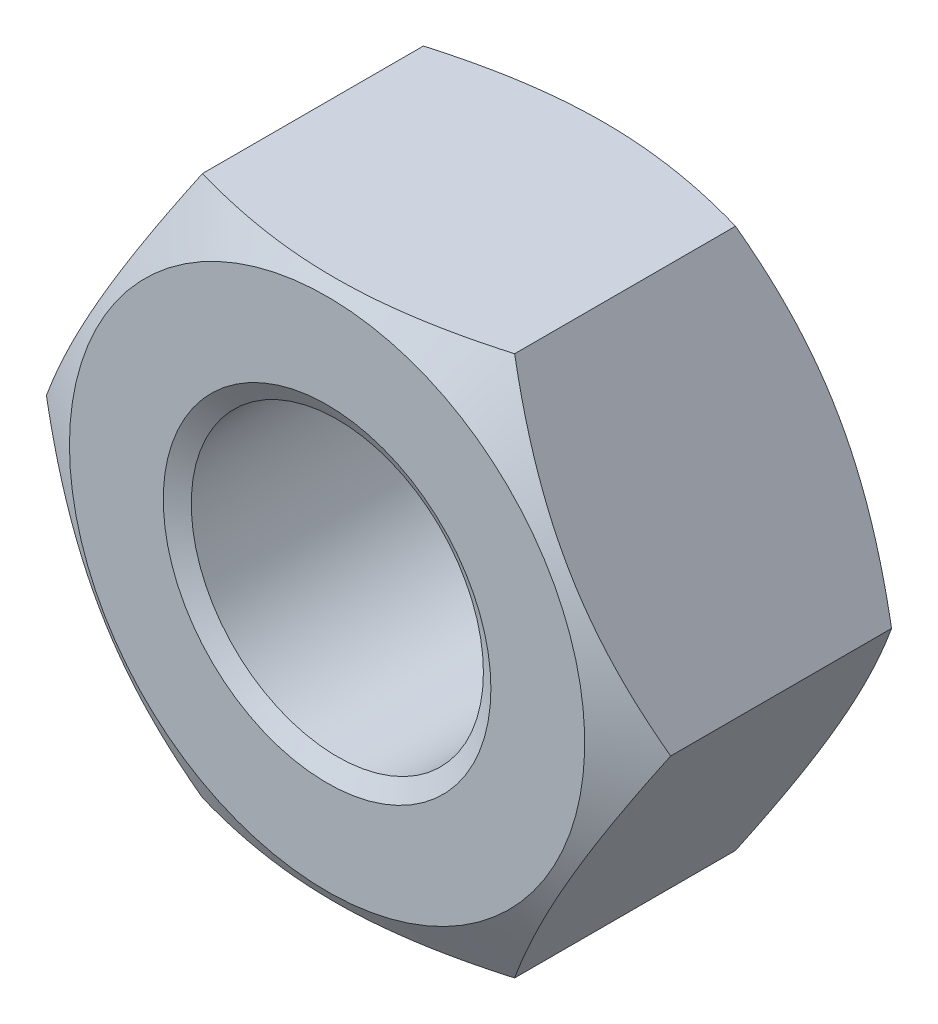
ISO-10303-21;
HEADER;
FILE_DESCRIPTION(('STEP AP214'),'2;1');
FILE_NAME('part.step','',(''),(''),'','','');
FILE_SCHEMA(('AUTOMOTIVE_DESIGN { 1 0 10303 214 1 1 1 1 }'));
ENDSEC;
DATA;
#1=APPLICATION_CONTEXT('core data for automotive mechanical design processes');
#2=APPLICATION_PROTOCOL_DEFINITION('international standard','automotive_design',2000,#1);
#3=PRODUCT_CONTEXT('',#1,'mechanical');
#4=PRODUCT('Part','Part','',(#3));
#5=PRODUCT_RELATED_PRODUCT_CATEGORY('part','',(#4));
#6=PRODUCT_DEFINITION_FORMATION('','',#4);
#7=PRODUCT_DEFINITION_CONTEXT('part definition',#1,'design');
#8=PRODUCT_DEFINITION('design','',#6,#7);
#9=PRODUCT_DEFINITION_SHAPE('','',#8);
#10=(LENGTH_UNIT() NAMED_UNIT(*) SI_UNIT(.MILLI.,.METRE.));
#11=(NAMED_UNIT(*) PLANE_ANGLE_UNIT() SI_UNIT($,.RADIAN.));
#12=(NAMED_UNIT(*) SI_UNIT($,.STERADIAN.) SOLID_ANGLE_UNIT());
#13=UNCERTAINTY_MEASURE_WITH_UNIT(LENGTH_MEASURE(1.E-05),#10,'distance_accuracy_value','');
#14=(GEOMETRIC_REPRESENTATION_CONTEXT(3) GLOBAL_UNCERTAINTY_ASSIGNED_CONTEXT((#13)) GLOBAL_UNIT_ASSIGNED_CONTEXT((#10,
#11,#12)) REPRESENTATION_CONTEXT('',''));
#15=CARTESIAN_POINT('',(0.,0.,0.));
#16=DIRECTION('',(0.,0.,1.));
#17=DIRECTION('',(1.,0.,0.));
#18=AXIS2_PLACEMENT_3D('',#15,#16,#17);
#19=CARTESIAN_POINT('',(-13.856406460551,-8.,0.));
#20=DIRECTION('',(0.,0.,-1.));
#21=DIRECTION('',(-1.,0.,0.));
#22=AXIS2_PLACEMENT_3D('',#19,#20,#21);
#23=PLANE('',#22);
#24=CARTESIAN_POINT('',(0.,0.,0.));
#25=DIRECTION('',(0.,0.,-1.));
#26=DIRECTION('',(-1.,0.,0.));
#27=AXIS2_PLACEMENT_3D('',#24,#25,#26);
#28=CIRCLE('',#27,7.625);
#29=CARTESIAN_POINT('',(-7.625,0.,0.));
#30=VERTEX_POINT('',#29);
#31=EDGE_CURVE('E136',#30,#30,#28,.T.);
#32=ORIENTED_EDGE('',*,*,#31,.F.);
#33=EDGE_LOOP('',(#32));
#34=FACE_BOUND('',#33,.T.);
#35=CARTESIAN_POINT('',(0.,0.,0.));
#36=DIRECTION('',(0.,0.,1.));
#37=DIRECTION('',(1.,0.,0.));
#38=AXIS2_PLACEMENT_3D('',#35,#36,#37);
#39=CIRCLE('',#38,4.84849999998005);
#40=CARTESIAN_POINT('',(4.84849999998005,0.,0.));
#41=VERTEX_POINT('',#40);
#42=EDGE_CURVE('E20',#41,#41,#39,.F.);
#43=ORIENTED_EDGE('',*,*,#42,.T.);
#44=EDGE_LOOP('',(#43));
#45=FACE_BOUND('',#44,.T.);
#46=ADVANCED_FACE('F17',(#34,#45),#23,.F.);
#47=CARTESIAN_POINT('',(0.,0.,0.));
#48=DIRECTION('',(0.,0.,1.));
#49=DIRECTION('',(1.,0.,0.));
#50=AXIS2_PLACEMENT_3D('',#47,#48,#49);
#51=CONICAL_SURFACE('',#50,4.84849999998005,1.04719755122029);
#52=CARTESIAN_POINT('',(0.,0.,-0.303108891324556));
#53=DIRECTION('',(0.,0.,1.));
#54=DIRECTION('',(1.,0.,0.));
#55=AXIS2_PLACEMENT_3D('',#52,#53,#54);
#56=CIRCLE('',#55,4.3235);
#57=CARTESIAN_POINT('',(4.3235,0.,-0.303108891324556));
#58=VERTEX_POINT('',#57);
#59=EDGE_CURVE('E71',#58,#58,#56,.F.);
#60=ORIENTED_EDGE('',*,*,#59,.T.);
#61=EDGE_LOOP('',(#60));
#62=FACE_BOUND('',#61,.T.);
#63=ORIENTED_EDGE('',*,*,#42,.F.);
#64=EDGE_LOOP('',(#63));
#65=FACE_BOUND('',#64,.T.);
#66=ADVANCED_FACE('F111',(#62,#65),#51,.F.);
#67=CARTESIAN_POINT('',(0.,0.,-0.936623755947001));
#68=DIRECTION('',(0.,0.,-1.));
#69=DIRECTION('',(-1.,0.,0.));
#70=AXIS2_PLACEMENT_3D('',#67,#68,#69);
#71=CONICAL_SURFACE('',#70,9.24727993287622,1.0471975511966);
#72=CARTESIAN_POINT('',(9.23760430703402,0.,-0.931037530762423));
#73=CARTESIAN_POINT('',(9.13607893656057,-0.175847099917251,-0.872433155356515));
#74=CARTESIAN_POINT('',(9.03417504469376,-0.352349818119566,-0.816488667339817));
#75=CARTESIAN_POINT('',(8.82953967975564,-0.7067886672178,-0.710652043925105));
#76=CARTESIAN_POINT('',(8.72680786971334,-0.884725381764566,-0.660762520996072));
#77=CARTESIAN_POINT('',(8.41696767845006,-1.42138433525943,-0.521155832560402));
#78=CARTESIAN_POINT('',(8.20863625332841,-1.78222494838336,-0.441750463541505));
#79=CARTESIAN_POINT('',(7.89687232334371,-2.32221591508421,-0.348640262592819));
#80=CARTESIAN_POINT('',(7.79437112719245,-2.49975319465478,-0.322116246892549));
#81=CARTESIAN_POINT('',(7.5889052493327,-2.85563053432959,-0.277640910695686));
#82=CARTESIAN_POINT('',(7.48594060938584,-3.0339705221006,-0.259688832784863));
#83=CARTESIAN_POINT('',(7.2798340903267,-3.39095748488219,-0.232812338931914));
#84=CARTESIAN_POINT('',(7.17669254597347,-3.56960388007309,-0.223877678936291));
#85=CARTESIAN_POINT('',(6.97031423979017,-3.92706159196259,-0.215227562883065));
#86=CARTESIAN_POINT('',(6.86707748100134,-4.10587290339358,-0.215511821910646));
#87=CARTESIAN_POINT('',(6.67408002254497,-4.44015430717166,-0.224657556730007));
#88=CARTESIAN_POINT('',(6.58430568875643,-4.59564801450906,-0.232403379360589));
#89=CARTESIAN_POINT('',(6.40496729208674,-4.90627122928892,-0.254716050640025));
#90=CARTESIAN_POINT('',(6.31540324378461,-5.06140071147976,-0.269283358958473));
#91=CARTESIAN_POINT('',(6.04705785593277,-5.52618855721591,-0.32287323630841));
#92=CARTESIAN_POINT('',(5.86875148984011,-5.83502424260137,-0.371777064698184));
#93=CARTESIAN_POINT('',(5.51024760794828,-6.4559711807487,-0.494034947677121));
#94=CARTESIAN_POINT('',(5.33009583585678,-6.76800320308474,-0.567907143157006));
#95=CARTESIAN_POINT('',(4.97247850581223,-7.38741458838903,-0.735565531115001));
#96=CARTESIAN_POINT('',(4.79500836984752,-7.69480188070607,-0.829312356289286));
#97=CARTESIAN_POINT('',(4.618802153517,-8.,-0.93103753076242));
#98=B_SPLINE_CURVE_WITH_KNOTS('',3,(#72,#73,#74,#75,#76,#77,#78,#79,#80,#81,#82,#83,#84,#85,#86,
#87,#88,#89,#90,#91,#92,#93,#94,#95,#96,#97),.UNSPECIFIED.,.F.,.F.,(4,2,2,2,2,2,2,2,2,2,2,2,4),
(0.,0.633965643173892,1.26820385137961,2.53931507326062,3.15930423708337,3.77923860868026,
4.39846792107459,5.01767809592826,5.55669078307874,6.09573979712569,7.17460544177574,
8.27739515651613,9.37802056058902),.UNSPECIFIED.);
#99=CARTESIAN_POINT('',(9.23760430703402,0.,-0.931037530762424));
#100=VERTEX_POINT('',#99);
#101=CARTESIAN_POINT('',(4.618802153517,-8.,-0.931037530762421));
#102=VERTEX_POINT('',#101);
#103=EDGE_CURVE('E62',#100,#102,#98,.T.);
#104=ORIENTED_EDGE('',*,*,#103,.F.);
#105=CARTESIAN_POINT('',(4.618802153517,8.00000000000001,-0.931037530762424));
#106=CARTESIAN_POINT('',(4.72032752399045,7.82415290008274,-0.872433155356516));
#107=CARTESIAN_POINT('',(4.82223141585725,7.64765018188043,-0.816488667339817));
#108=CARTESIAN_POINT('',(5.02686678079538,7.2932113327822,-0.710652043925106));
#109=CARTESIAN_POINT('',(5.12959859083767,7.11527461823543,-0.660762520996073));
#110=CARTESIAN_POINT('',(5.43943878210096,6.57861566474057,-0.521155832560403));
#111=CARTESIAN_POINT('',(5.64777020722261,6.21777505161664,-0.441750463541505));
#112=CARTESIAN_POINT('',(5.95953413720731,5.67778408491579,-0.34864026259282));
#113=CARTESIAN_POINT('',(6.06203533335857,5.50024680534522,-0.322116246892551));
#114=CARTESIAN_POINT('',(6.26750121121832,5.1443694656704,-0.277640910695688));
#115=CARTESIAN_POINT('',(6.37046585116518,4.9660294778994,-0.259688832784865));
#116=CARTESIAN_POINT('',(6.57657237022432,4.6090425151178,-0.232812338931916));
#117=CARTESIAN_POINT('',(6.67971391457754,4.4303961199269,-0.223877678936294));
#118=CARTESIAN_POINT('',(6.88609222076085,4.07293840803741,-0.215227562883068));
#119=CARTESIAN_POINT('',(6.98932897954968,3.89412709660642,-0.215511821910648));
#120=CARTESIAN_POINT('',(7.18232643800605,3.55984569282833,-0.224657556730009));
#121=CARTESIAN_POINT('',(7.27210077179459,3.40435198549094,-0.232403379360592));
#122=CARTESIAN_POINT('',(7.45143916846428,3.09372877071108,-0.254716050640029));
#123=CARTESIAN_POINT('',(7.54100321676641,2.93859928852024,-0.269283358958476));
#124=CARTESIAN_POINT('',(7.80934860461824,2.47381144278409,-0.322873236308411));
#125=CARTESIAN_POINT('',(7.9876549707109,2.16497575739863,-0.371777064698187));
#126=CARTESIAN_POINT('',(8.34615885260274,1.5440288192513,-0.494034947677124));
#127=CARTESIAN_POINT('',(8.52631062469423,1.23199679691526,-0.567907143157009));
#128=CARTESIAN_POINT('',(8.88392795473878,0.612585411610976,-0.735565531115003));
#129=CARTESIAN_POINT('',(9.0613980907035,0.305198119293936,-0.829312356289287));
#130=CARTESIAN_POINT('',(9.23760430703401,0.,-0.931037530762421));
#131=B_SPLINE_CURVE_WITH_KNOTS('',3,(#105,#106,#107,#108,#109,#110,#111,#112,#113,#114,#115,
#116,#117,#118,#119,#120,#121,#122,#123,#124,#125,#126,#127,#128,#129,#130),.UNSPECIFIED.,.F.,
.F.,(4,2,2,2,2,2,2,2,2,2,2,2,4),(0.,0.633965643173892,1.26820385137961,2.53931507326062,
3.15930423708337,3.77923860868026,4.39846792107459,5.01767809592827,5.55669078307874,
6.09573979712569,7.17460544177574,8.27739515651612,9.37802056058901),.UNSPECIFIED.);
#132=CARTESIAN_POINT('',(4.618802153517,8.,-0.931037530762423));
#133=VERTEX_POINT('',#132);
#134=EDGE_CURVE('E66',#133,#100,#131,.T.);
#135=ORIENTED_EDGE('',*,*,#134,.F.);
#136=CARTESIAN_POINT('',(-4.618802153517,8.,-0.931037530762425));
#137=CARTESIAN_POINT('',(-4.41575141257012,8.,-0.872433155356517));
#138=CARTESIAN_POINT('',(-4.2119436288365,8.,-0.816488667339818));
#139=CARTESIAN_POINT('',(-3.80267289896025,8.,-0.710652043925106));
#140=CARTESIAN_POINT('',(-3.59720927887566,8.,-0.660762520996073));
#141=CARTESIAN_POINT('',(-2.9775288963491,8.,-0.521155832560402));
#142=CARTESIAN_POINT('',(-2.5608660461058,8.,-0.441750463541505));
#143=CARTESIAN_POINT('',(-1.93733818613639,8.,-0.34864026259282));
#144=CARTESIAN_POINT('',(-1.73233579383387,8.,-0.322116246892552));
#145=CARTESIAN_POINT('',(-1.32140403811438,8.,-0.277640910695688));
#146=CARTESIAN_POINT('',(-1.11547475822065,8.,-0.259688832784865));
#147=CARTESIAN_POINT('',(-0.703261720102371,8.,-0.232812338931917));
#148=CARTESIAN_POINT('',(-0.496978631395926,8.,-0.223877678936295));
#149=CARTESIAN_POINT('',(-0.0842220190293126,8.,-0.215227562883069));
#150=CARTESIAN_POINT('',(0.122251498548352,8.,-0.215511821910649));
#151=CARTESIAN_POINT('',(0.508246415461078,8.,-0.224657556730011));
#152=CARTESIAN_POINT('',(0.687795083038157,8.,-0.232403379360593));
#153=CARTESIAN_POINT('',(1.04647187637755,8.,-0.25471605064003));
#154=CARTESIAN_POINT('',(1.22559997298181,8.,-0.269283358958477));
#155=CARTESIAN_POINT('',(1.76229074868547,8.,-0.322873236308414));
#156=CARTESIAN_POINT('',(2.11890348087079,8.,-0.371777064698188));
#157=CARTESIAN_POINT('',(2.83591124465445,8.,-0.494034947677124));
#158=CARTESIAN_POINT('',(3.19621478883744,8.,-0.567907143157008));
#159=CARTESIAN_POINT('',(3.91144944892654,8.,-0.735565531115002));
#160=CARTESIAN_POINT('',(4.26638972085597,8.,-0.829312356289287));
#161=CARTESIAN_POINT('',(4.618802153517,8.,-0.931037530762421));
#162=B_SPLINE_CURVE_WITH_KNOTS('',3,(#136,#137,#138,#139,#140,#141,#142,#143,#144,#145,#146,
#147,#148,#149,#150,#151,#152,#153,#154,#155,#156,#157,#158,#159,#160,#161),.UNSPECIFIED.,.F.,
.F.,(4,2,2,2,2,2,2,2,2,2,2,2,4),(0.,0.633965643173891,1.26820385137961,2.53931507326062,
3.15930423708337,3.77923860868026,4.39846792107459,5.01767809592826,5.55669078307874,
6.09573979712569,7.17460544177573,8.27739515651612,9.37802056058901),.UNSPECIFIED.);
#163=CARTESIAN_POINT('',(-4.618802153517,8.,-0.931037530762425));
#164=VERTEX_POINT('',#163);
#165=EDGE_CURVE('E85',#164,#133,#162,.T.);
#166=ORIENTED_EDGE('',*,*,#165,.F.);
#167=CARTESIAN_POINT('',(-9.23760430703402,0.,-0.931037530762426));
#168=CARTESIAN_POINT('',(-9.13607893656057,0.175847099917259,-0.872433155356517));
#169=CARTESIAN_POINT('',(-9.03417504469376,0.352349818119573,-0.816488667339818));
#170=CARTESIAN_POINT('',(-8.82953967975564,0.706788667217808,-0.710652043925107));
#171=CARTESIAN_POINT('',(-8.72680786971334,0.884725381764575,-0.660762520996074));
#172=CARTESIAN_POINT('',(-8.41696767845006,1.42138433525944,-0.521155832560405));
#173=CARTESIAN_POINT('',(-8.20863625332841,1.78222494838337,-0.441750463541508));
#174=CARTESIAN_POINT('',(-7.89687232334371,2.32221591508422,-0.348640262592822));
#175=CARTESIAN_POINT('',(-7.79437112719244,2.49975319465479,-0.322116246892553));
#176=CARTESIAN_POINT('',(-7.5889052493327,2.8556305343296,-0.277640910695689));
#177=CARTESIAN_POINT('',(-7.48594060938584,3.03397052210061,-0.259688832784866));
#178=CARTESIAN_POINT('',(-7.2798340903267,3.3909574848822,-0.232812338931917));
#179=CARTESIAN_POINT('',(-7.17669254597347,3.5696038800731,-0.223877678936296));
#180=CARTESIAN_POINT('',(-6.97031423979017,3.9270615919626,-0.21522756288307));
#181=CARTESIAN_POINT('',(-6.86707748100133,4.10587290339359,-0.21551182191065));
#182=CARTESIAN_POINT('',(-6.67408002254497,4.44015430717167,-0.224657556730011));
#183=CARTESIAN_POINT('',(-6.58430568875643,4.59564801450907,-0.232403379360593));
#184=CARTESIAN_POINT('',(-6.40496729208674,4.90627122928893,-0.25471605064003));
#185=CARTESIAN_POINT('',(-6.31540324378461,5.06140071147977,-0.269283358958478));
#186=CARTESIAN_POINT('',(-6.04705785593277,5.52618855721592,-0.322873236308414));
#187=CARTESIAN_POINT('',(-5.86875148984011,5.83502424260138,-0.371777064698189));
#188=CARTESIAN_POINT('',(-5.51024760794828,6.45597118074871,-0.494034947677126));
#189=CARTESIAN_POINT('',(-5.33009583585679,6.76800320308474,-0.567907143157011));
#190=CARTESIAN_POINT('',(-4.97247850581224,7.38741458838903,-0.735565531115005));
#191=CARTESIAN_POINT('',(-4.79500836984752,7.69480188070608,-0.82931235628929));
#192=CARTESIAN_POINT('',(-4.61880215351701,8.,-0.931037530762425));
#193=B_SPLINE_CURVE_WITH_KNOTS('',3,(#167,#168,#169,#170,#171,#172,#173,#174,#175,#176,#177,
#178,#179,#180,#181,#182,#183,#184,#185,#186,#187,#188,#189,#190,#191,#192),.UNSPECIFIED.,.F.,
.F.,(4,2,2,2,2,2,2,2,2,2,2,2,4),(0.,0.633965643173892,1.26820385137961,2.53931507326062,
3.15930423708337,3.77923860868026,4.39846792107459,5.01767809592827,5.55669078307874,
6.09573979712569,7.17460544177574,8.27739515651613,9.37802056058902),.UNSPECIFIED.);
#194=CARTESIAN_POINT('',(-9.23760430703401,0.,-0.931037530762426));
#195=VERTEX_POINT('',#194);
#196=EDGE_CURVE('E114',#195,#164,#193,.T.);
#197=ORIENTED_EDGE('',*,*,#196,.F.);
#198=CARTESIAN_POINT('',(-4.618802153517,-8.,-0.931037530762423));
#199=CARTESIAN_POINT('',(-4.72032752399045,-7.82415290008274,-0.872433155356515));
#200=CARTESIAN_POINT('',(-4.82223141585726,-7.64765018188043,-0.816488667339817));
#201=CARTESIAN_POINT('',(-5.02686678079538,-7.29321133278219,-0.710652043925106));
#202=CARTESIAN_POINT('',(-5.12959859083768,-7.11527461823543,-0.660762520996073));
#203=CARTESIAN_POINT('',(-5.43943878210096,-6.57861566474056,-0.521155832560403));
#204=CARTESIAN_POINT('',(-5.64777020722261,-6.21777505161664,-0.441750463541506));
#205=CARTESIAN_POINT('',(-5.95953413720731,-5.67778408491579,-0.348640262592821));
#206=CARTESIAN_POINT('',(-6.06203533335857,-5.50024680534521,-0.322116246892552));
#207=CARTESIAN_POINT('',(-6.26750121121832,-5.1443694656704,-0.277640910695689));
#208=CARTESIAN_POINT('',(-6.37046585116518,-4.96602947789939,-0.259688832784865));
#209=CARTESIAN_POINT('',(-6.57657237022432,-4.6090425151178,-0.232812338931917));
#210=CARTESIAN_POINT('',(-6.67971391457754,-4.4303961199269,-0.223877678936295));
#211=CARTESIAN_POINT('',(-6.88609222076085,-4.07293840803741,-0.21522756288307));
#212=CARTESIAN_POINT('',(-6.98932897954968,-3.89412709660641,-0.215511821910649));
#213=CARTESIAN_POINT('',(-7.18232643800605,-3.55984569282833,-0.22465755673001));
#214=CARTESIAN_POINT('',(-7.27210077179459,-3.40435198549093,-0.232403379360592));
#215=CARTESIAN_POINT('',(-7.45143916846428,-3.09372877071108,-0.25471605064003));
#216=CARTESIAN_POINT('',(-7.54100321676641,-2.93859928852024,-0.269283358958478));
#217=CARTESIAN_POINT('',(-7.80934860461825,-2.47381144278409,-0.322873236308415));
#218=CARTESIAN_POINT('',(-7.9876549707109,-2.16497575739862,-0.371777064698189));
#219=CARTESIAN_POINT('',(-8.34615885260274,-1.5440288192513,-0.494034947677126));
#220=CARTESIAN_POINT('',(-8.52631062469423,-1.23199679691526,-0.567907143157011));
#221=CARTESIAN_POINT('',(-8.88392795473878,-0.612585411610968,-0.735565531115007));
#222=CARTESIAN_POINT('',(-9.0613980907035,-0.305198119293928,-0.829312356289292));
#223=CARTESIAN_POINT('',(-9.23760430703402,0.,-0.931037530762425));
#224=B_SPLINE_CURVE_WITH_KNOTS('',3,(#198,#199,#200,#201,#202,#203,#204,#205,#206,#207,#208,
#209,#210,#211,#212,#213,#214,#215,#216,#217,#218,#219,#220,#221,#222,#223),.UNSPECIFIED.,.F.,
.F.,(4,2,2,2,2,2,2,2,2,2,2,2,4),(0.,0.633965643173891,1.26820385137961,2.53931507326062,
3.15930423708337,3.77923860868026,4.39846792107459,5.01767809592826,5.55669078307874,
6.09573979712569,7.17460544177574,8.27739515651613,9.37802056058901),.UNSPECIFIED.);
#225=CARTESIAN_POINT('',(-4.618802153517,-8.,-0.931037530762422));
#226=VERTEX_POINT('',#225);
#227=EDGE_CURVE('E122',#226,#195,#224,.T.);
#228=ORIENTED_EDGE('',*,*,#227,.F.);
#229=CARTESIAN_POINT('',(4.618802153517,-8.,-0.93103753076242));
#230=CARTESIAN_POINT('',(4.41575141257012,-8.,-0.872433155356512));
#231=CARTESIAN_POINT('',(4.2119436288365,-8.,-0.816488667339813));
#232=CARTESIAN_POINT('',(3.80267289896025,-8.,-0.710652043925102));
#233=CARTESIAN_POINT('',(3.59720927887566,-8.,-0.660762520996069));
#234=CARTESIAN_POINT('',(2.9775288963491,-8.,-0.521155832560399));
#235=CARTESIAN_POINT('',(2.5608660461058,-8.,-0.441750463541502));
#236=CARTESIAN_POINT('',(1.93733818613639,-8.,-0.348640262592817));
#237=CARTESIAN_POINT('',(1.73233579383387,-8.,-0.322116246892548));
#238=CARTESIAN_POINT('',(1.32140403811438,-8.,-0.277640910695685));
#239=CARTESIAN_POINT('',(1.11547475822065,-8.,-0.259688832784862));
#240=CARTESIAN_POINT('',(0.703261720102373,-8.,-0.232812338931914));
#241=CARTESIAN_POINT('',(0.496978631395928,-8.,-0.223877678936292));
#242=CARTESIAN_POINT('',(0.0842220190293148,-8.,-0.215227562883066));
#243=CARTESIAN_POINT('',(-0.12225149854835,-8.,-0.215511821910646));
#244=CARTESIAN_POINT('',(-0.508246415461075,-8.,-0.224657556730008));
#245=CARTESIAN_POINT('',(-0.687795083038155,-8.,-0.23240337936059));
#246=CARTESIAN_POINT('',(-1.04647187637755,-8.,-0.254716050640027));
#247=CARTESIAN_POINT('',(-1.2255999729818,-8.,-0.269283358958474));
#248=CARTESIAN_POINT('',(-1.76229074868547,-8.,-0.322873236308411));
#249=CARTESIAN_POINT('',(-2.11890348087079,-8.,-0.371777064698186));
#250=CARTESIAN_POINT('',(-2.83591124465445,-8.,-0.494034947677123));
#251=CARTESIAN_POINT('',(-3.19621478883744,-8.,-0.567907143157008));
#252=CARTESIAN_POINT('',(-3.91144944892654,-8.,-0.735565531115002));
#253=CARTESIAN_POINT('',(-4.26638972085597,-8.,-0.829312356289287));
#254=CARTESIAN_POINT('',(-4.618802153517,-8.,-0.931037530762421));
#255=B_SPLINE_CURVE_WITH_KNOTS('',3,(#229,#230,#231,#232,#233,#234,#235,#236,#237,#238,#239,
#240,#241,#242,#243,#244,#245,#246,#247,#248,#249,#250,#251,#252,#253,#254),.UNSPECIFIED.,.F.,
.F.,(4,2,2,2,2,2,2,2,2,2,2,2,4),(0.,0.633965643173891,1.26820385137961,2.53931507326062,
3.15930423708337,3.77923860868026,4.39846792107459,5.01767809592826,5.55669078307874,
6.09573979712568,7.17460544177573,8.27739515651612,9.37802056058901),.UNSPECIFIED.);
#256=EDGE_CURVE('E69',#102,#226,#255,.T.);
#257=ORIENTED_EDGE('',*,*,#256,.F.);
#258=EDGE_LOOP('',(#104,#135,#166,#197,#228,#257));
#259=FACE_BOUND('',#258,.T.);
#260=ORIENTED_EDGE('',*,*,#31,.T.);
#261=EDGE_LOOP('',(#260));
#262=FACE_BOUND('',#261,.T.);
#263=ADVANCED_FACE('F63',(#259,#262),#71,.T.);
#264=CARTESIAN_POINT('',(0.,0.,-8.4));
#265=DIRECTION('',(0.,0.,1.));
#266=DIRECTION('',(1.,0.,0.));
#267=AXIS2_PLACEMENT_3D('',#264,#265,#266);
#268=CYLINDRICAL_SURFACE('',#267,4.3235);
#269=CARTESIAN_POINT('',(0.,0.,-7.87500000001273));
#270=DIRECTION('',(0.,0.,-1.));
#271=DIRECTION('',(-1.,0.,0.));
#272=AXIS2_PLACEMENT_3D('',#269,#270,#271);
#273=CIRCLE('',#272,4.32349999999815);
#274=CARTESIAN_POINT('',(-4.32349999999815,0.,-7.87500000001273));
#275=VERTEX_POINT('',#274);
#276=EDGE_CURVE('E185',#275,#275,#273,.T.);
#277=ORIENTED_EDGE('',*,*,#276,.T.);
#278=EDGE_LOOP('',(#277));
#279=FACE_BOUND('',#278,.T.);
#280=ORIENTED_EDGE('',*,*,#59,.F.);
#281=EDGE_LOOP('',(#280));
#282=FACE_BOUND('',#281,.T.);
#283=ADVANCED_FACE('F110',(#279,#282),#268,.F.);
#284=CARTESIAN_POINT('',(4.618802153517,-8.,-8.4));
#285=DIRECTION('',(0.866025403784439,-0.5,0.));
#286=DIRECTION('',(0.5,0.866025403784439,0.));
#287=AXIS2_PLACEMENT_3D('',#284,#285,#286);
#288=PLANE('',#287);
#289=CARTESIAN_POINT('',(9.23760430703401,0.,-7.46896246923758));
#290=CARTESIAN_POINT('',(9.13607893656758,-0.175847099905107,-7.52756684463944));
#291=CARTESIAN_POINT('',(9.03417504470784,-0.352349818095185,-7.58351133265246));
#292=CARTESIAN_POINT('',(8.82953967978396,-0.706788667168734,-7.68934795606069));
#293=CARTESIAN_POINT('',(8.72680786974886,-0.884725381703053,-7.73923747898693));
#294=CARTESIAN_POINT('',(8.41696767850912,-1.42138433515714,-7.87884416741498));
#295=CARTESIAN_POINT('',(8.20863625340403,-1.78222494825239,-7.95824953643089));
#296=CARTESIAN_POINT('',(7.89687232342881,-2.3222159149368,-8.05135973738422));
#297=CARTESIAN_POINT('',(7.79437112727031,-2.49975319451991,-8.07788375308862));
#298=CARTESIAN_POINT('',(7.58890524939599,-2.85563053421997,-8.1223590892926));
#299=CARTESIAN_POINT('',(7.48594060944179,-3.03397052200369,-8.14031116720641));
#300=CARTESIAN_POINT('',(7.27983409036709,-3.39095748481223,-8.16718766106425));
#301=CARTESIAN_POINT('',(7.17669254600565,-3.56960388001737,-8.17612232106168));
#302=CARTESIAN_POINT('',(6.97031423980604,-3.92706159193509,-8.18477243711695));
#303=CARTESIAN_POINT('',(6.86707748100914,-4.10587290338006,-8.18448817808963));
#304=CARTESIAN_POINT('',(6.67408002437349,-4.44015430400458,-8.17534244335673));
#305=CARTESIAN_POINT('',(6.58430569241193,-4.59564800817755,-8.16759662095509));
#306=CARTESIAN_POINT('',(6.40496729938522,-4.90627121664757,-8.14528395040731));
#307=CARTESIAN_POINT('',(6.31540325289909,-5.06140069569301,-8.13071664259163));
#308=CARTESIAN_POINT('',(6.04705787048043,-5.52618853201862,-8.07712676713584));
#309=CARTESIAN_POINT('',(5.86875150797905,-5.83502421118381,-8.02822294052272));
#310=CARTESIAN_POINT('',(5.51024763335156,-6.45597113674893,-7.90596506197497));
#311=CARTESIAN_POINT('',(5.33009586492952,-6.76800315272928,-7.83209286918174));
#312=CARTESIAN_POINT('',(4.97247854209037,-7.38741452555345,-7.66443448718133));
#313=CARTESIAN_POINT('',(4.79500840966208,-7.69480181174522,-7.57068766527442));
#314=CARTESIAN_POINT('',(4.61880219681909,-7.99999992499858,-7.46896249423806));
#315=B_SPLINE_CURVE_WITH_KNOTS('',3,(#289,#290,#291,#292,#293,#294,#295,#296,#297,#298,#299,
#300,#301,#302,#303,#304,#305,#306,#307,#308,#309,#310,#311,#312,#313,#314),.UNSPECIFIED.,.F.,
.F.,(4,2,2,2,2,2,2,2,2,2,2,2,4),(0.,0.633965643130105,1.26820385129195,2.53931507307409,
3.15930423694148,3.77923860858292,4.39846792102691,5.01767809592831,5.55669077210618,
6.09573977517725,7.17460539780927,8.27739508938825,9.37802047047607),.UNSPECIFIED.);
#316=CARTESIAN_POINT('',(9.23760430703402,0.,-7.46896246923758));
#317=VERTEX_POINT('',#316);
#318=CARTESIAN_POINT('',(4.61880217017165,-8.,-7.4689624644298));
#319=VERTEX_POINT('',#318);
#320=EDGE_CURVE('E35',#317,#319,#315,.T.);
#321=ORIENTED_EDGE('',*,*,#320,.F.);
#322=DIRECTION('',(0.,0.,1.));
#323=VECTOR('',#322,1.);
#324=CARTESIAN_POINT('',(9.23760430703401,0.,-8.4));
#325=LINE('',#324,#323);
#326=EDGE_CURVE('E73',#100,#317,#325,.F.);
#327=ORIENTED_EDGE('',*,*,#326,.F.);
#328=ORIENTED_EDGE('',*,*,#103,.T.);
#329=DIRECTION('',(0.,0.,-1.));
#330=VECTOR('',#329,1.);
#331=CARTESIAN_POINT('',(4.618802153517,-8.,-8.4));
#332=LINE('',#331,#330);
#333=EDGE_CURVE('E188',#319,#102,#332,.F.);
#334=ORIENTED_EDGE('',*,*,#333,.F.);
#335=EDGE_LOOP('',(#321,#327,#328,#334));
#336=FACE_BOUND('',#335,.T.);
#337=ADVANCED_FACE('F74',(#336),#288,.T.);
#338=CARTESIAN_POINT('',(-4.61880215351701,-8.,-8.4));
#339=DIRECTION('',(0.,-1.,0.));
#340=DIRECTION('',(0.,0.,-1.));
#341=AXIS2_PLACEMENT_3D('',#338,#339,#340);
#342=PLANE('',#341);
#343=CARTESIAN_POINT('',(4.6188021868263,-8.,-7.46896245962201));
#344=CARTESIAN_POINT('',(4.41575144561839,-8.,-7.52756683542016));
#345=CARTESIAN_POINT('',(4.21194366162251,-8.,-7.58351132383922));
#346=CARTESIAN_POINT('',(3.80267293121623,-8.,-7.68934794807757));
#347=CARTESIAN_POINT('',(3.59720931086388,-8.,-7.73923747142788));
#348=CARTESIAN_POINT('',(2.9775289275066,-8.,-7.87884416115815));
#349=CARTESIAN_POINT('',(2.56086607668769,-8.,-7.9582495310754));
#350=CARTESIAN_POINT('',(1.93733821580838,-8.,-8.05135973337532));
#351=CARTESIAN_POINT('',(1.73233582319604,-8.,-8.07788374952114));
#352=CARTESIAN_POINT('',(1.32140406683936,-8.,-8.12235908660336));
#353=CARTESIAN_POINT('',(1.11547478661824,-8.,-8.14031116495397));
#354=CARTESIAN_POINT('',(0.703261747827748,-8.,-8.16718765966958));
#355=CARTESIAN_POINT('',(0.496978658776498,-8.,-8.17612232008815));
#356=CARTESIAN_POINT('',(0.0842220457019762,-8.,-8.18477243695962));
#357=CARTESIAN_POINT('',(-0.122251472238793,-8.,-8.18448817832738));
#358=CARTESIAN_POINT('',(-0.508246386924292,-8.,-8.17534244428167));
#359=CARTESIAN_POINT('',(-0.687795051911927,-8.,-8.16759662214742));
#360=CARTESIAN_POINT('',(-1.04647184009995,-8.,-8.14528395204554));
#361=CARTESIAN_POINT('',(-1.22559993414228,-8.,-8.13071664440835));
#362=CARTESIAN_POINT('',(-1.76229070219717,-8.,-8.07712676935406));
#363=CARTESIAN_POINT('',(-2.11890342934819,-8.,-8.02822294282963));
#364=CARTESIAN_POINT('',(-2.83591118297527,-8.,-7.90596506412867));
#365=CARTESIAN_POINT('',(-3.19621472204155,-8.,-7.832092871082));
#366=CARTESIAN_POINT('',(-3.9114493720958,-8.,-7.66443448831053));
#367=CARTESIAN_POINT('',(-4.26638963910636,-8.,-7.57068766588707));
#368=CARTESIAN_POINT('',(-4.6188020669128,-8.,-7.46896249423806));
#369=B_SPLINE_CURVE_WITH_KNOTS('',3,(#343,#344,#345,#346,#347,#348,#349,#350,#351,#352,#353,
#354,#355,#356,#357,#358,#359,#360,#361,#362,#363,#364,#365,#366,#367,#368),.UNSPECIFIED.,.F.,
.F.,(4,2,2,2,2,2,2,2,2,2,2,2,4),(0.,0.633965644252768,1.26820385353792,2.53931507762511,
3.15930424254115,3.77923861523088,4.39846792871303,5.01767810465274,5.55669078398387,
6.095739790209,7.17460541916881,8.27739511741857,9.37802050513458),.UNSPECIFIED.);
#370=CARTESIAN_POINT('',(-4.61880214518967,-8.00000001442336,-7.46896246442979));
#371=VERTEX_POINT('',#370);
#372=EDGE_CURVE('E147',#319,#371,#369,.T.);
#373=ORIENTED_EDGE('',*,*,#372,.F.);
#374=ORIENTED_EDGE('',*,*,#333,.T.);
#375=ORIENTED_EDGE('',*,*,#256,.T.);
#376=DIRECTION('',(0.,0.,1.));
#377=VECTOR('',#376,1.);
#378=CARTESIAN_POINT('',(-4.618802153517,-8.00000000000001,-8.4));
#379=LINE('',#378,#377);
#380=EDGE_CURVE('E190',#371,#226,#379,.T.);
#381=ORIENTED_EDGE('',*,*,#380,.F.);
#382=EDGE_LOOP('',(#373,#374,#375,#381));
#383=FACE_BOUND('',#382,.T.);
#384=ADVANCED_FACE('F139',(#383),#342,.T.);
#385=CARTESIAN_POINT('',(-9.23760430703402,0.,-8.4));
#386=DIRECTION('',(-0.866025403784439,-0.5,0.));
#387=DIRECTION('',(0.5,-0.866025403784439,0.));
#388=AXIS2_PLACEMENT_3D('',#385,#386,#387);
#389=PLANE('',#388);
#390=CARTESIAN_POINT('',(-4.61880213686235,-8.00000002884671,-7.46896245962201));
#391=CARTESIAN_POINT('',(-4.72032750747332,-7.82415292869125,-7.5275668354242));
#392=CARTESIAN_POINT('',(-4.82223139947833,-7.64765021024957,-7.58351132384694));
#393=CARTESIAN_POINT('',(-5.02686676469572,-7.29321136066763,-7.68934794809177));
#394=CARTESIAN_POINT('',(-5.12959857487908,-7.11527464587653,-7.73923747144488));
#395=CARTESIAN_POINT('',(-5.43943876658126,-6.57861569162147,-7.87884416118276));
#396=CARTESIAN_POINT('',(-5.64777019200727,-6.21777507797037,-7.95824953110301));
#397=CARTESIAN_POINT('',(-5.95953412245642,-5.67778411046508,-8.05135973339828));
#398=CARTESIAN_POINT('',(-6.06203531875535,-5.50024683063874,-8.07788374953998));
#399=CARTESIAN_POINT('',(-6.26750119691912,-5.14436949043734,-8.12235908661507));
#400=CARTESIAN_POINT('',(-6.37046583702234,-4.96602950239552,-8.14031116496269));
#401=CARTESIAN_POINT('',(-6.57657235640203,-4.60904253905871,-8.16718765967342));
#402=CARTESIAN_POINT('',(-6.67971390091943,-4.43039614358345,-8.17612232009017));
#403=CARTESIAN_POINT('',(-6.88609220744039,-4.07293843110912,-8.18477243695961));
#404=CARTESIAN_POINT('',(-6.98932896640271,-3.89412711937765,-8.18448817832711));
#405=CARTESIAN_POINT('',(-7.18232642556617,-3.55984571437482,-8.17534244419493));
#406=CARTESIAN_POINT('',(-7.27210075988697,-3.40435200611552,-8.16759662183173));
#407=CARTESIAN_POINT('',(-7.45143915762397,-3.09372878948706,-8.1452839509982));
#408=CARTESIAN_POINT('',(-7.54100320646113,-2.9385993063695,-8.13071664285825));
#409=CARTESIAN_POINT('',(-7.80934859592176,-2.47381145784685,-8.07712676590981));
#410=CARTESIAN_POINT('',(-7.98765496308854,-2.16497577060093,-8.02822293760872));
#411=CARTESIAN_POINT('',(-8.34615884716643,-1.54402882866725,-7.90596505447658));
#412=CARTESIAN_POINT('',(-8.52631062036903,-1.23199680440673,-7.83209285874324));
#413=CARTESIAN_POINT('',(-8.88392795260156,-0.612585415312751,-7.66443447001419));
#414=CARTESIAN_POINT('',(-9.06139808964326,-0.305198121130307,-7.57068764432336));
#415=CARTESIAN_POINT('',(-9.23760430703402,0.,-7.46896246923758));
#416=B_SPLINE_CURVE_WITH_KNOTS('',3,(#390,#391,#392,#393,#394,#395,#396,#397,#398,#399,#400,
#401,#402,#403,#404,#405,#406,#407,#408,#409,#410,#411,#412,#413,#414,#415),.UNSPECIFIED.,.F.,
.F.,(4,2,2,2,2,2,2,2,2,2,2,2,4),(0.,0.633965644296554,1.26820385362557,2.53931507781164,
3.15930424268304,3.77923861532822,4.39846792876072,5.0176781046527,5.55669079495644,
6.09573981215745,7.1746054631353,8.27739518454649,9.37802059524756),.UNSPECIFIED.);
#417=CARTESIAN_POINT('',(-9.23760430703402,0.,-7.46896246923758));
#418=VERTEX_POINT('',#417);
#419=EDGE_CURVE('E153',#371,#418,#416,.T.);
#420=ORIENTED_EDGE('',*,*,#419,.F.);
#421=ORIENTED_EDGE('',*,*,#380,.T.);
#422=ORIENTED_EDGE('',*,*,#227,.T.);
#423=DIRECTION('',(0.,0.,1.));
#424=VECTOR('',#423,1.);
#425=CARTESIAN_POINT('',(-9.23760430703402,0.,-8.4));
#426=LINE('',#425,#424);
#427=EDGE_CURVE('E193',#418,#195,#426,.T.);
#428=ORIENTED_EDGE('',*,*,#427,.F.);
#429=EDGE_LOOP('',(#420,#421,#422,#428));
#430=FACE_BOUND('',#429,.T.);
#431=ADVANCED_FACE('F143',(#430),#389,.T.);
#432=CARTESIAN_POINT('',(-4.61880215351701,8.,-8.4));
#433=DIRECTION('',(-0.866025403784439,0.5,0.));
#434=DIRECTION('',(-0.5,-0.866025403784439,0.));
#435=AXIS2_PLACEMENT_3D('',#432,#433,#434);
#436=PLANE('',#435);
#437=CARTESIAN_POINT('',(-9.23760430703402,0.,-7.46896246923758));
#438=CARTESIAN_POINT('',(-9.13607893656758,0.17584709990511,-7.52756684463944));
#439=CARTESIAN_POINT('',(-9.03417504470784,0.352349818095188,-7.58351133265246));
#440=CARTESIAN_POINT('',(-8.82953967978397,0.706788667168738,-7.68934795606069));
#441=CARTESIAN_POINT('',(-8.72680786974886,0.884725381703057,-7.73923747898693));
#442=CARTESIAN_POINT('',(-8.41696767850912,1.42138433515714,-7.87884416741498));
#443=CARTESIAN_POINT('',(-8.20863625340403,1.78222494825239,-7.95824953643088));
#444=CARTESIAN_POINT('',(-7.89687232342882,2.32221591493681,-8.05135973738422));
#445=CARTESIAN_POINT('',(-7.79437112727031,2.49975319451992,-8.07788375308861));
#446=CARTESIAN_POINT('',(-7.58890524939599,2.85563053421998,-8.12235908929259));
#447=CARTESIAN_POINT('',(-7.48594060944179,3.03397052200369,-8.14031116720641));
#448=CARTESIAN_POINT('',(-7.27983409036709,3.39095748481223,-8.16718766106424));
#449=CARTESIAN_POINT('',(-7.17669254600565,3.56960388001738,-8.17612232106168));
#450=CARTESIAN_POINT('',(-6.97031423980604,3.9270615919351,-8.18477243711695));
#451=CARTESIAN_POINT('',(-6.86707748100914,4.10587290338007,-8.18448817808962));
#452=CARTESIAN_POINT('',(-6.67408002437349,4.44015430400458,-8.17534244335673));
#453=CARTESIAN_POINT('',(-6.58430569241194,4.59564800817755,-8.16759662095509));
#454=CARTESIAN_POINT('',(-6.40496729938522,4.90627121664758,-8.14528395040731));
#455=CARTESIAN_POINT('',(-6.31540325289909,5.06140069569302,-8.13071664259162));
#456=CARTESIAN_POINT('',(-6.04705787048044,5.52618853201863,-8.07712676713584));
#457=CARTESIAN_POINT('',(-5.86875150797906,5.83502421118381,-8.02822294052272));
#458=CARTESIAN_POINT('',(-5.51024763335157,6.45597113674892,-7.90596506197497));
#459=CARTESIAN_POINT('',(-5.33009586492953,6.76800315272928,-7.83209286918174));
#460=CARTESIAN_POINT('',(-4.97247854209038,7.38741452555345,-7.66443448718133));
#461=CARTESIAN_POINT('',(-4.79500840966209,7.69480181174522,-7.57068766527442));
#462=CARTESIAN_POINT('',(-4.6188021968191,7.99999992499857,-7.46896249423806));
#463=B_SPLINE_CURVE_WITH_KNOTS('',3,(#437,#438,#439,#440,#441,#442,#443,#444,#445,#446,#447,
#448,#449,#450,#451,#452,#453,#454,#455,#456,#457,#458,#459,#460,#461,#462),.UNSPECIFIED.,.F.,
.F.,(4,2,2,2,2,2,2,2,2,2,2,2,4),(0.,0.633965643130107,1.26820385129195,2.53931507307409,
3.15930423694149,3.77923860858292,4.39846792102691,5.01767809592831,5.55669077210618,
6.09573977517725,7.17460539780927,8.27739508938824,9.37802047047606),.UNSPECIFIED.);
#464=CARTESIAN_POINT('',(-4.61880217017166,8.,-7.46896246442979));
#465=VERTEX_POINT('',#464);
#466=EDGE_CURVE('E210',#418,#465,#463,.T.);
#467=ORIENTED_EDGE('',*,*,#466,.F.);
#468=ORIENTED_EDGE('',*,*,#427,.T.);
#469=ORIENTED_EDGE('',*,*,#196,.T.);
#470=DIRECTION('',(0.,0.,1.));
#471=VECTOR('',#470,1.);
#472=CARTESIAN_POINT('',(-4.61880215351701,8.,-8.4));
#473=LINE('',#472,#471);
#474=EDGE_CURVE('E82',#465,#164,#473,.T.);
#475=ORIENTED_EDGE('',*,*,#474,.F.);
#476=EDGE_LOOP('',(#467,#468,#469,#475));
#477=FACE_BOUND('',#476,.T.);
#478=ADVANCED_FACE('F201',(#477),#436,.T.);
#479=CARTESIAN_POINT('',(4.618802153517,8.,-8.4));
#480=DIRECTION('',(0.,1.,0.));
#481=DIRECTION('',(0.,0.,1.));
#482=AXIS2_PLACEMENT_3D('',#479,#480,#481);
#483=PLANE('',#482);
#484=CARTESIAN_POINT('',(-4.61880218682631,8.,-7.46896245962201));
#485=CARTESIAN_POINT('',(-4.41575144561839,8.,-7.52756683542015));
#486=CARTESIAN_POINT('',(-4.21194366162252,8.,-7.58351132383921));
#487=CARTESIAN_POINT('',(-3.80267293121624,8.,-7.68934794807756));
#488=CARTESIAN_POINT('',(-3.59720931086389,8.,-7.73923747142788));
#489=CARTESIAN_POINT('',(-2.97752892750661,8.,-7.87884416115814));
#490=CARTESIAN_POINT('',(-2.5608660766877,8.,-7.9582495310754));
#491=CARTESIAN_POINT('',(-1.93733821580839,8.,-8.05135973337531));
#492=CARTESIAN_POINT('',(-1.73233582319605,8.,-8.07788374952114));
#493=CARTESIAN_POINT('',(-1.32140406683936,8.,-8.12235908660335));
#494=CARTESIAN_POINT('',(-1.11547478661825,8.,-8.14031116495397));
#495=CARTESIAN_POINT('',(-0.703261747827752,8.,-8.16718765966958));
#496=CARTESIAN_POINT('',(-0.496978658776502,8.,-8.17612232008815));
#497=CARTESIAN_POINT('',(-0.0842220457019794,8.,-8.18477243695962));
#498=CARTESIAN_POINT('',(0.12225147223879,8.,-8.18448817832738));
#499=CARTESIAN_POINT('',(0.508246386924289,8.,-8.17534244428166));
#500=CARTESIAN_POINT('',(0.687795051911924,8.,-8.16759662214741));
#501=CARTESIAN_POINT('',(1.04647184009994,8.,-8.14528395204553));
#502=CARTESIAN_POINT('',(1.22559993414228,8.,-8.13071664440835));
#503=CARTESIAN_POINT('',(1.76229070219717,8.,-8.07712676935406));
#504=CARTESIAN_POINT('',(2.11890342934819,8.,-8.02822294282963));
#505=CARTESIAN_POINT('',(2.83591118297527,8.,-7.90596506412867));
#506=CARTESIAN_POINT('',(3.19621472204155,8.,-7.832092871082));
#507=CARTESIAN_POINT('',(3.9114493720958,8.,-7.66443448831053));
#508=CARTESIAN_POINT('',(4.26638963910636,8.,-7.57068766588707));
#509=CARTESIAN_POINT('',(4.6188020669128,8.,-7.46896249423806));
#510=B_SPLINE_CURVE_WITH_KNOTS('',3,(#484,#485,#486,#487,#488,#489,#490,#491,#492,#493,#494,
#495,#496,#497,#498,#499,#500,#501,#502,#503,#504,#505,#506,#507,#508,#509),.UNSPECIFIED.,.F.,
.F.,(4,2,2,2,2,2,2,2,2,2,2,2,4),(0.,0.633965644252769,1.26820385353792,2.53931507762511,
3.15930424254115,3.77923861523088,4.39846792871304,5.01767810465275,5.55669078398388,
6.09573979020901,7.17460541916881,8.27739511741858,9.37802050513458),.UNSPECIFIED.);
#511=CARTESIAN_POINT('',(4.61880214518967,8.00000001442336,-7.46896246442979));
#512=VERTEX_POINT('',#511);
#513=EDGE_CURVE('E168',#465,#512,#510,.T.);
#514=ORIENTED_EDGE('',*,*,#513,.F.);
#515=ORIENTED_EDGE('',*,*,#474,.T.);
#516=ORIENTED_EDGE('',*,*,#165,.T.);
#517=DIRECTION('',(0.,0.,1.));
#518=VECTOR('',#517,1.);
#519=CARTESIAN_POINT('',(4.618802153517,8.00000000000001,-8.4));
#520=LINE('',#519,#518);
#521=EDGE_CURVE('E78',#512,#133,#520,.T.);
#522=ORIENTED_EDGE('',*,*,#521,.F.);
#523=EDGE_LOOP('',(#514,#515,#516,#522));
#524=FACE_BOUND('',#523,.T.);
#525=ADVANCED_FACE('F205',(#524),#483,.T.);
#526=CARTESIAN_POINT('',(9.23760430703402,0.,-8.4));
#527=DIRECTION('',(0.866025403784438,0.5,0.));
#528=DIRECTION('',(-0.5,0.866025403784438,0.));
#529=AXIS2_PLACEMENT_3D('',#526,#527,#528);
#530=PLANE('',#529);
#531=CARTESIAN_POINT('',(4.61880213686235,8.00000002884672,-7.46896245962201));
#532=CARTESIAN_POINT('',(4.72032750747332,7.82415292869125,-7.5275668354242));
#533=CARTESIAN_POINT('',(4.82223139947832,7.64765021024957,-7.58351132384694));
#534=CARTESIAN_POINT('',(5.02686676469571,7.29321136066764,-7.68934794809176));
#535=CARTESIAN_POINT('',(5.12959857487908,7.11527464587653,-7.73923747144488));
#536=CARTESIAN_POINT('',(5.43943876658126,6.57861569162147,-7.87884416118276));
#537=CARTESIAN_POINT('',(5.64777019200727,6.21777507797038,-7.958249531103));
#538=CARTESIAN_POINT('',(5.95953412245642,5.67778411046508,-8.05135973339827));
#539=CARTESIAN_POINT('',(6.06203531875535,5.50024683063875,-8.07788374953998));
#540=CARTESIAN_POINT('',(6.26750119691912,5.14436949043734,-8.12235908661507));
#541=CARTESIAN_POINT('',(6.37046583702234,4.96602950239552,-8.14031116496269));
#542=CARTESIAN_POINT('',(6.57657235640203,4.60904253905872,-8.16718765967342));
#543=CARTESIAN_POINT('',(6.67971390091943,4.43039614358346,-8.17612232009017));
#544=CARTESIAN_POINT('',(6.88609220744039,4.07293843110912,-8.18477243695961));
#545=CARTESIAN_POINT('',(6.9893289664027,3.89412711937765,-8.18448817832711));
#546=CARTESIAN_POINT('',(7.18232642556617,3.55984571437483,-8.17534244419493));
#547=CARTESIAN_POINT('',(7.27210075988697,3.40435200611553,-8.16759662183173));
#548=CARTESIAN_POINT('',(7.45143915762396,3.09372878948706,-8.1452839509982));
#549=CARTESIAN_POINT('',(7.54100320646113,2.93859930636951,-8.13071664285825));
#550=CARTESIAN_POINT('',(7.80934859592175,2.47381145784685,-8.07712676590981));
#551=CARTESIAN_POINT('',(7.98765496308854,2.16497577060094,-8.02822293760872));
#552=CARTESIAN_POINT('',(8.34615884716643,1.54402882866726,-7.90596505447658));
#553=CARTESIAN_POINT('',(8.52631062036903,1.23199680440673,-7.83209285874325));
#554=CARTESIAN_POINT('',(8.88392795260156,0.612585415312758,-7.66443447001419));
#555=CARTESIAN_POINT('',(9.06139808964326,0.305198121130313,-7.57068764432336));
#556=CARTESIAN_POINT('',(9.23760430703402,0.,-7.46896246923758));
#557=B_SPLINE_CURVE_WITH_KNOTS('',3,(#531,#532,#533,#534,#535,#536,#537,#538,#539,#540,#541,
#542,#543,#544,#545,#546,#547,#548,#549,#550,#551,#552,#553,#554,#555,#556),.UNSPECIFIED.,.F.,
.F.,(4,2,2,2,2,2,2,2,2,2,2,2,4),(0.,0.633965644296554,1.26820385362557,2.53931507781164,
3.15930424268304,3.77923861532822,4.39846792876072,5.0176781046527,5.55669079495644,
6.09573981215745,7.1746054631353,8.27739518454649,9.37802059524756),.UNSPECIFIED.);
#558=EDGE_CURVE('E176',#512,#317,#557,.T.);
#559=ORIENTED_EDGE('',*,*,#558,.F.);
#560=ORIENTED_EDGE('',*,*,#521,.T.);
#561=ORIENTED_EDGE('',*,*,#134,.T.);
#562=ORIENTED_EDGE('',*,*,#326,.T.);
#563=EDGE_LOOP('',(#559,#560,#561,#562));
#564=FACE_BOUND('',#563,.T.);
#565=ADVANCED_FACE('F81',(#564),#530,.T.);
#566=CARTESIAN_POINT('',(0.,0.,-8.3999999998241));
#567=DIRECTION('',(0.,0.,-1.));
#568=DIRECTION('',(-1.,0.,0.));
#569=AXIS2_PLACEMENT_3D('',#566,#567,#568);
#570=CONICAL_SURFACE('',#569,4.6266088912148,0.523598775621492);
#571=ORIENTED_EDGE('',*,*,#276,.F.);
#572=EDGE_LOOP('',(#571));
#573=FACE_BOUND('',#572,.T.);
#574=CARTESIAN_POINT('',(0.,0.,-8.40000000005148));
#575=DIRECTION('',(0.,0.,-1.));
#576=DIRECTION('',(-1.,0.,0.));
#577=AXIS2_PLACEMENT_3D('',#574,#575,#576);
#578=CIRCLE('',#577,4.62660889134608);
#579=CARTESIAN_POINT('',(-4.62660889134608,0.,-8.40000000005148));
#580=VERTEX_POINT('',#579);
#581=EDGE_CURVE('E26',#580,#580,#578,.F.);
#582=ORIENTED_EDGE('',*,*,#581,.F.);
#583=EDGE_LOOP('',(#582));
#584=FACE_BOUND('',#583,.T.);
#585=ADVANCED_FACE('F163',(#573,#584),#570,.F.);
#586=CARTESIAN_POINT('',(0.,0.,-7.463376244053));
#587=DIRECTION('',(0.,0.,1.));
#588=DIRECTION('',(1.,0.,0.));
#589=AXIS2_PLACEMENT_3D('',#586,#587,#588);
#590=CONICAL_SURFACE('',#589,9.24727993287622,1.0471975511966);
#591=ORIENTED_EDGE('',*,*,#419,.T.);
#592=ORIENTED_EDGE('',*,*,#466,.T.);
#593=ORIENTED_EDGE('',*,*,#513,.T.);
#594=ORIENTED_EDGE('',*,*,#558,.T.);
#595=ORIENTED_EDGE('',*,*,#320,.T.);
#596=ORIENTED_EDGE('',*,*,#372,.T.);
#597=EDGE_LOOP('',(#591,#592,#593,#594,#595,#596));
#598=FACE_BOUND('',#597,.T.);
#599=CARTESIAN_POINT('',(0.,0.,-8.4));
#600=DIRECTION('',(0.,0.,1.));
#601=DIRECTION('',(1.,0.,0.));
#602=AXIS2_PLACEMENT_3D('',#599,#600,#601);
#603=CIRCLE('',#602,7.625);
#604=CARTESIAN_POINT('',(7.62500000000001,0.,-8.4));
#605=VERTEX_POINT('',#604);
#606=EDGE_CURVE('E11',#605,#605,#603,.F.);
#607=ORIENTED_EDGE('',*,*,#606,.F.);
#608=EDGE_LOOP('',(#607));
#609=FACE_BOUND('',#608,.T.);
#610=ADVANCED_FACE('F158',(#598,#609),#590,.T.);
#611=CARTESIAN_POINT('',(-13.856406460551,-8.,-8.4));
#612=DIRECTION('',(0.,0.,-1.));
#613=DIRECTION('',(-1.,0.,0.));
#614=AXIS2_PLACEMENT_3D('',#611,#612,#613);
#615=PLANE('',#614);
#616=ORIENTED_EDGE('',*,*,#606,.T.);
#617=EDGE_LOOP('',(#616));
#618=FACE_BOUND('',#617,.T.);
#619=ORIENTED_EDGE('',*,*,#581,.T.);
#620=EDGE_LOOP('',(#619));
#621=FACE_BOUND('',#620,.T.);
#622=ADVANCED_FACE('F162',(#618,#621),#615,.T.);
#623=CLOSED_SHELL('',(#46,#66,#263,#283,#337,#384,#431,#478,#525,#565,#585,#610,#622));
#624=MANIFOLD_SOLID_BREP('B1',#623);
#625=ADVANCED_BREP_SHAPE_REPRESENTATION('',(#18,#624),#14);
#626=SHAPE_DEFINITION_REPRESENTATION(#9,#625);
ENDSEC;
END-ISO-10303-21;
